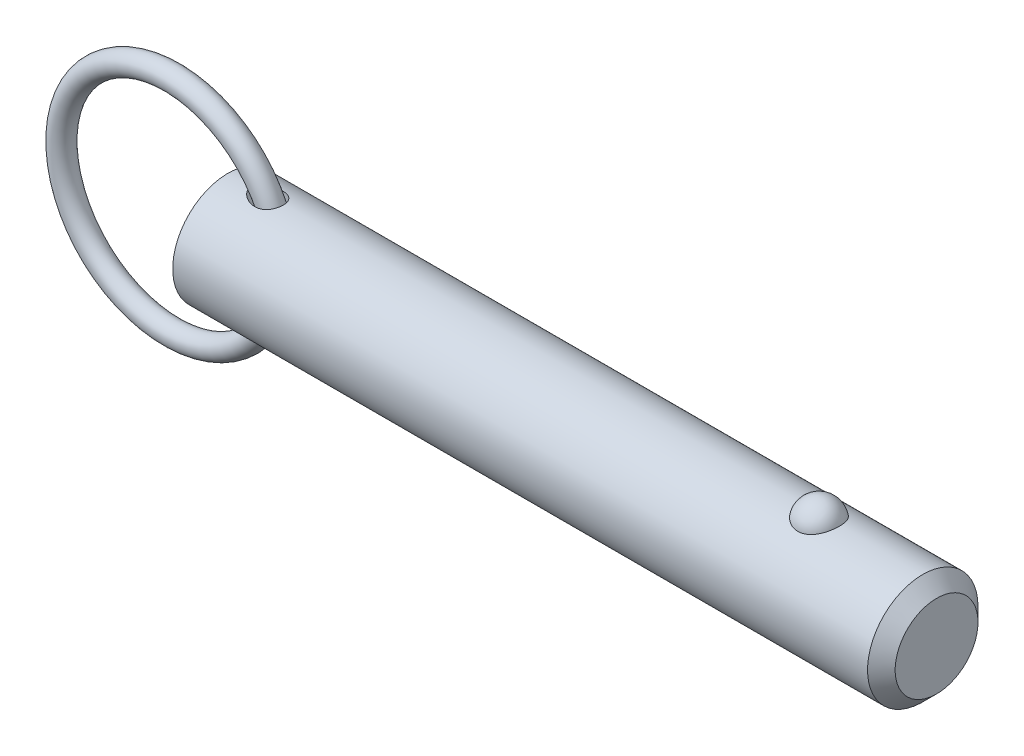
ISO-10303-21;
HEADER;
FILE_DESCRIPTION(('STEP AP214'),'2;1');
FILE_NAME('part.step','',(''),(''),'','','');
FILE_SCHEMA(('AUTOMOTIVE_DESIGN { 1 0 10303 214 1 1 1 1 }'));
ENDSEC;
DATA;
#1=APPLICATION_CONTEXT('core data for automotive mechanical design processes');
#2=APPLICATION_PROTOCOL_DEFINITION('international standard','automotive_design',2000,#1);
#3=PRODUCT_CONTEXT('',#1,'mechanical');
#4=PRODUCT('Part','Part','',(#3));
#5=PRODUCT_RELATED_PRODUCT_CATEGORY('part','',(#4));
#6=PRODUCT_DEFINITION_FORMATION('','',#4);
#7=PRODUCT_DEFINITION_CONTEXT('part definition',#1,'design');
#8=PRODUCT_DEFINITION('design','',#6,#7);
#9=PRODUCT_DEFINITION_SHAPE('','',#8);
#10=(LENGTH_UNIT() NAMED_UNIT(*) SI_UNIT(.MILLI.,.METRE.));
#11=(NAMED_UNIT(*) PLANE_ANGLE_UNIT() SI_UNIT($,.RADIAN.));
#12=(NAMED_UNIT(*) SI_UNIT($,.STERADIAN.) SOLID_ANGLE_UNIT());
#13=UNCERTAINTY_MEASURE_WITH_UNIT(LENGTH_MEASURE(1.E-05),#10,'distance_accuracy_value','');
#14=(GEOMETRIC_REPRESENTATION_CONTEXT(3) GLOBAL_UNCERTAINTY_ASSIGNED_CONTEXT((#13)) GLOBAL_UNIT_ASSIGNED_CONTEXT((#10,
#11,#12)) REPRESENTATION_CONTEXT('',''));
#15=CARTESIAN_POINT('',(0.,0.,0.));
#16=DIRECTION('',(0.,0.,1.));
#17=DIRECTION('',(1.,0.,0.));
#18=AXIS2_PLACEMENT_3D('',#15,#16,#17);
#19=CARTESIAN_POINT('',(-9.66825126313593,0.,0.));
#20=DIRECTION('',(0.,0.,1.));
#21=DIRECTION('',(1.,0.,0.));
#22=AXIS2_PLACEMENT_3D('',#19,#20,#21);
#23=TOROIDAL_SURFACE('',#22,19.05,1.905);
#24=CARTESIAN_POINT('',(11.2867487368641,0.,0.));
#25=VERTEX_POINT('',#24);
#26=VERTEX_LOOP('',#25);
#27=FACE_BOUND('',#26,.T.);
#28=ADVANCED_FACE('P0_F12',(#27),#23,.T.);
#29=CLOSED_SHELL('',(#28));
#30=MANIFOLD_SOLID_BREP('P0_B1',#29);
#31=CARTESIAN_POINT('',(0.,0.,0.));
#32=DIRECTION('',(1.,0.,0.));
#33=DIRECTION('',(0.,0.,-1.));
#34=AXIS2_PLACEMENT_3D('',#31,#32,#33);
#35=CYLINDRICAL_SURFACE('',#34,9.525);
#36=CARTESIAN_POINT('',(4.56693409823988,9.43141941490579,-1.33189820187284));
#37=CARTESIAN_POINT('',(4.70260475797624,9.41020313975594,-1.48215931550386));
#38=CARTESIAN_POINT('',(4.85555680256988,9.38755003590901,-1.61683982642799));
#39=CARTESIAN_POINT('',(5.10171959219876,9.35450554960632,-1.79512943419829));
#40=CARTESIAN_POINT('',(5.18674514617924,9.34362629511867,-1.85068909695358));
#41=CARTESIAN_POINT('',(5.36154389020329,9.32258514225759,-1.95392002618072));
#42=CARTESIAN_POINT('',(5.45131542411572,9.31242299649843,-2.00159402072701));
#43=CARTESIAN_POINT('',(5.70070211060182,9.28632120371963,-2.12033289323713));
#44=CARTESIAN_POINT('',(5.86420408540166,9.27146938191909,-2.18362944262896));
#45=CARTESIAN_POINT('',(6.19893345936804,9.24694163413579,-2.28525783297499));
#46=CARTESIAN_POINT('',(6.37015384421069,9.23726110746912,-2.32361187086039));
#47=CARTESIAN_POINT('',(6.73531776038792,9.22400982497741,-2.37575048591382));
#48=CARTESIAN_POINT('',(6.92975826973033,9.22118808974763,-2.38652934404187));
#49=CARTESIAN_POINT('',(7.21995443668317,9.22416297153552,-2.37494980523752));
#50=CARTESIAN_POINT('',(7.31643847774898,9.22635560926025,-2.366466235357));
#51=CARTESIAN_POINT('',(7.50796421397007,9.2331428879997,-2.33985028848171));
#52=CARTESIAN_POINT('',(7.60300650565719,9.23773650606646,-2.32172202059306));
#53=CARTESIAN_POINT('',(7.83273114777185,9.25183311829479,-2.26504721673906));
#54=CARTESIAN_POINT('',(7.96603028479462,9.26261470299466,-2.2209856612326));
#55=CARTESIAN_POINT('',(8.22310899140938,9.28816519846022,-2.11157306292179));
#56=CARTESIAN_POINT('',(8.34689477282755,9.30293147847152,-2.04623606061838));
#57=CARTESIAN_POINT('',(8.58136049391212,9.3349416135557,-1.89485344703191));
#58=CARTESIAN_POINT('',(8.69199721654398,9.35219324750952,-1.80874222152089));
#59=CARTESIAN_POINT('',(8.89592093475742,9.38707016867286,-1.61799188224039));
#60=CARTESIAN_POINT('',(8.98920771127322,9.40469546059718,-1.51335253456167));
#61=CARTESIAN_POINT('',(9.15057731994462,9.43713590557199,-1.29519427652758));
#62=CARTESIAN_POINT('',(9.21980158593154,9.45205440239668,-1.18253282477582));
#63=CARTESIAN_POINT('',(9.33826736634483,9.47856708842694,-0.946802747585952));
#64=CARTESIAN_POINT('',(9.38751161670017,9.49016173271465,-0.823735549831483));
#65=CARTESIAN_POINT('',(9.46423850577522,9.50859378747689,-0.572614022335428));
#66=CARTESIAN_POINT('',(9.4920239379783,9.5154972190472,-0.444656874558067));
#67=CARTESIAN_POINT('',(9.52636926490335,9.52406905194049,-0.185752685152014));
#68=CARTESIAN_POINT('',(9.5329292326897,9.52573747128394,-0.0548056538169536));
#69=CARTESIAN_POINT('',(9.52467276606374,9.52365852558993,0.206503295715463));
#70=CARTESIAN_POINT('',(9.50983454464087,9.51990564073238,0.336864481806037));
#71=CARTESIAN_POINT('',(9.45907362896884,9.50737852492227,0.59316631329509));
#72=CARTESIAN_POINT('',(9.42315106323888,9.49860432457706,0.71910698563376));
#73=CARTESIAN_POINT('',(9.33106648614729,9.47698928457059,0.96295935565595));
#74=CARTESIAN_POINT('',(9.27490839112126,9.46414923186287,1.08087260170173));
#75=CARTESIAN_POINT('',(9.1437580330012,9.43581000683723,1.30534632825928));
#76=CARTESIAN_POINT('',(9.06876720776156,9.42031103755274,1.41190767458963));
#77=CARTESIAN_POINT('',(8.90203187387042,9.38836719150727,1.61069439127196));
#78=CARTESIAN_POINT('',(8.81029913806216,9.37192298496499,1.70292975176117));
#79=CARTESIAN_POINT('',(8.61268775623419,9.33985045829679,1.87086859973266));
#80=CARTESIAN_POINT('',(8.50680947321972,9.3242221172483,1.94657251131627));
#81=CARTESIAN_POINT('',(8.28220546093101,9.29513431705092,2.08109032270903));
#82=CARTESIAN_POINT('',(8.16329919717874,9.28171415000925,2.1396103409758));
#83=CARTESIAN_POINT('',(7.91756052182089,9.25859072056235,2.23755716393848));
#84=CARTESIAN_POINT('',(7.79072606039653,9.24888842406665,2.27697900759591));
#85=CARTESIAN_POINT('',(7.52377913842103,9.23338749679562,2.33907806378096));
#86=CARTESIAN_POINT('',(7.38334767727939,9.22789571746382,2.36044900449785));
#87=CARTESIAN_POINT('',(7.10081394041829,9.22210229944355,2.3829751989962));
#88=CARTESIAN_POINT('',(6.95871103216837,9.22180269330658,2.38412253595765));
#89=CARTESIAN_POINT('',(6.65642691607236,9.22632724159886,2.36656230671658));
#90=CARTESIAN_POINT('',(6.49641694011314,9.23185415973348,2.3451317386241));
#91=CARTESIAN_POINT('',(6.18115433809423,9.24811737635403,2.28014143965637));
#92=CARTESIAN_POINT('',(6.02590710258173,9.25885936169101,2.23655754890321));
#93=CARTESIAN_POINT('',(5.6990472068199,9.28624254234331,2.12025087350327));
#94=CARTESIAN_POINT('',(5.52873601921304,9.30354853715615,2.04400672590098));
#95=CARTESIAN_POINT('',(5.20289495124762,9.34106989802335,1.86504730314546));
#96=CARTESIAN_POINT('',(5.04735968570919,9.36128419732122,1.76234172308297));
#97=CARTESIAN_POINT('',(4.79287124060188,9.39697639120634,1.55895334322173));
#98=CARTESIAN_POINT('',(4.68938704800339,9.41240250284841,1.46392900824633));
#99=CARTESIAN_POINT('',(4.49847141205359,9.44202586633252,1.25875918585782));
#100=CARTESIAN_POINT('',(4.41101129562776,9.45622528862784,1.1486413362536));
#101=CARTESIAN_POINT('',(4.27502257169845,9.47888210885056,0.940600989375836));
#102=CARTESIAN_POINT('',(4.22216329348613,9.48791121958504,0.845586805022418));
#103=CARTESIAN_POINT('',(4.13241478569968,9.50344321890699,0.648051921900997));
#104=CARTESIAN_POINT('',(4.09551182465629,9.50994827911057,0.545537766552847));
#105=CARTESIAN_POINT('',(4.04043124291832,9.51971586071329,0.334452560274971));
#106=CARTESIAN_POINT('',(4.02240728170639,9.52295176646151,0.225839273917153));
#107=CARTESIAN_POINT('',(4.00750873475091,9.52562364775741,0.00713006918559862));
#108=CARTESIAN_POINT('',(4.01062334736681,9.52506156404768,-0.10296506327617));
#109=CARTESIAN_POINT('',(4.03592967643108,9.52053221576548,-0.306944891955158));
#110=CARTESIAN_POINT('',(4.05571676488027,9.51699426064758,-0.401151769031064));
#111=CARTESIAN_POINT('',(4.10967975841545,9.5074546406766,-0.585176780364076));
#112=CARTESIAN_POINT('',(4.14385995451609,9.50145224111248,-0.674993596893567));
#113=CARTESIAN_POINT('',(4.23261356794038,9.48611703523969,-0.866116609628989));
#114=CARTESIAN_POINT('',(4.28990016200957,9.47635800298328,-0.96612166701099));
#115=CARTESIAN_POINT('',(4.41856577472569,9.45502867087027,-1.15640011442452));
#116=CARTESIAN_POINT('',(4.48996918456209,9.44345524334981,-1.24665623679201));
#117=CARTESIAN_POINT('',(4.56693409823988,9.43141941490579,-1.33189820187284));
#118=B_SPLINE_CURVE_WITH_KNOTS('',3,(#36,#37,#38,#39,#40,#41,#42,#43,#44,#45,#46,#47,#48,#49,
#50,#51,#52,#53,#54,#55,#56,#57,#58,#59,#60,#61,#62,#63,#64,#65,#66,#67,#68,#69,#70,#71,#72,#73,
#74,#75,#76,#77,#78,#79,#80,#81,#82,#83,#84,#85,#86,#87,#88,#89,#90,#91,#92,#93,#94,#95,#96,#97,
#98,#99,#100,#101,#102,#103,#104,#105,#106,#107,#108,#109,#110,#111,#112,#113,#114,#115,#116,
#117),.UNSPECIFIED.,.T.,.F.,(4,2,2,2,2,2,2,2,2,2,2,2,2,2,2,2,2,2,2,2,2,2,2,2,2,2,2,2,2,2,2,2,2,
2,2,2,2,2,2,2,4),(0.,0.609951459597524,0.916123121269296,1.22218863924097,1.74791337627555,
2.27316961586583,2.85362722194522,3.14383229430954,3.43391382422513,3.85437497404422,
4.27455920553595,4.69608835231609,5.11762282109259,5.5149005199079,5.91212379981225,
6.30363414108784,6.69514313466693,7.08705103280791,7.47895654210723,7.87078624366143,
8.26258603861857,8.65411137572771,9.04562666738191,9.44349251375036,9.84146165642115,
10.2662286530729,10.6911619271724,11.1739180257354,11.6572017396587,12.2170157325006,
12.7766249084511,13.1992556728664,13.6211226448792,13.9471990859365,14.2729943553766,
14.6014211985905,14.9296802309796,15.2173810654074,15.505167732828,15.8505863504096,
16.1966070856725),.UNSPECIFIED.);
#119=CARTESIAN_POINT('',(4.56693409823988,9.43141941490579,-1.33189820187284));
#120=VERTEX_POINT('',#119);
#121=EDGE_CURVE('P1_E40',#120,#120,#118,.T.);
#122=ORIENTED_EDGE('',*,*,#121,.T.);
#123=EDGE_LOOP('',(#122));
#124=FACE_BOUND('',#123,.T.);
#125=CARTESIAN_POINT('',(119.84875,0.,0.));
#126=DIRECTION('',(1.,0.,0.));
#127=DIRECTION('',(0.,0.,-1.));
#128=AXIS2_PLACEMENT_3D('',#125,#126,#127);
#129=CIRCLE('',#128,9.525);
#130=CARTESIAN_POINT('',(119.84875,0.,-9.525));
#131=VERTEX_POINT('',#130);
#132=EDGE_CURVE('P1_E25',#131,#131,#129,.T.);
#133=ORIENTED_EDGE('',*,*,#132,.F.);
#134=EDGE_LOOP('',(#133));
#135=FACE_BOUND('',#134,.T.);
#136=CARTESIAN_POINT('',(0.,0.,0.));
#137=DIRECTION('',(1.,0.,0.));
#138=DIRECTION('',(0.,0.,-1.));
#139=AXIS2_PLACEMENT_3D('',#136,#137,#138);
#140=CIRCLE('',#139,9.525);
#141=CARTESIAN_POINT('',(0.,0.,-9.525));
#142=VERTEX_POINT('',#141);
#143=EDGE_CURVE('P1_E9',#142,#142,#140,.T.);
#144=ORIENTED_EDGE('',*,*,#143,.T.);
#145=EDGE_LOOP('',(#144));
#146=FACE_BOUND('',#145,.T.);
#147=CARTESIAN_POINT('',(101.945757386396,8.80405803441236,3.63513233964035));
#148=CARTESIAN_POINT('',(101.851676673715,8.80405953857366,3.63513053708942));
#149=CARTESIAN_POINT('',(101.757561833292,8.80561325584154,3.6313746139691));
#150=CARTESIAN_POINT('',(101.570012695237,8.81177748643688,3.61638665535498));
#151=CARTESIAN_POINT('',(101.476578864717,8.81638992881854,3.60514990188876));
#152=CARTESIAN_POINT('',(101.197945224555,8.8346711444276,3.56024627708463));
#153=CARTESIAN_POINT('',(101.014691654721,8.85278327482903,3.51538626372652));
#154=CARTESIAN_POINT('',(100.659509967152,8.89871214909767,3.39742145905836));
#155=CARTESIAN_POINT('',(100.487553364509,8.9265032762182,3.32439116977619));
#156=CARTESIAN_POINT('',(100.158707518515,8.98874819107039,3.15220244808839));
#157=CARTESIAN_POINT('',(100.001811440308,9.02319893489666,3.05305594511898));
#158=CARTESIAN_POINT('',(99.7022147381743,9.09629186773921,2.82797815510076));
#159=CARTESIAN_POINT('',(99.5600600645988,9.13502685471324,2.7013513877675));
#160=CARTESIAN_POINT('',(99.2982999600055,9.2118657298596,2.4264193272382));
#161=CARTESIAN_POINT('',(99.1787015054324,9.2499694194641,2.27810735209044));
#162=CARTESIAN_POINT('',(98.959645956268,9.3234108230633,1.95652290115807));
#163=CARTESIAN_POINT('',(98.8613174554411,9.35855090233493,1.78243511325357));
#164=CARTESIAN_POINT('',(98.6938190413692,9.42045142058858,1.41937246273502));
#165=CARTESIAN_POINT('',(98.6246511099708,9.44721128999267,1.23039658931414));
#166=CARTESIAN_POINT('',(98.5161994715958,9.48990641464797,0.840370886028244));
#167=CARTESIAN_POINT('',(98.4772880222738,9.50570658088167,0.639202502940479));
#168=CARTESIAN_POINT('',(98.4315550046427,9.52433146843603,0.232664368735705));
#169=CARTESIAN_POINT('',(98.4247324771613,9.52715657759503,0.0272947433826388));
#170=CARTESIAN_POINT('',(98.443255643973,9.51956918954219,-0.380478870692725));
#171=CARTESIAN_POINT('',(98.4684052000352,9.50923740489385,-0.58289331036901));
#172=CARTESIAN_POINT('',(98.5500253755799,9.47651897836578,-0.980293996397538));
#173=CARTESIAN_POINT('',(98.6064966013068,9.45413210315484,-1.17528009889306));
#174=CARTESIAN_POINT('',(98.7497192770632,9.39954044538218,-1.55263697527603));
#175=CARTESIAN_POINT('',(98.8365124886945,9.36732213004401,-1.73498993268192));
#176=CARTESIAN_POINT('',(99.0386103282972,9.29640700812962,-2.08177763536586));
#177=CARTESIAN_POINT('',(99.1539172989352,9.25770966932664,-2.24621090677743));
#178=CARTESIAN_POINT('',(99.411264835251,9.17775604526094,-2.5533833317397));
#179=CARTESIAN_POINT('',(99.5534344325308,9.136488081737,-2.696011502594));
#180=CARTESIAN_POINT('',(99.86089985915,9.05620497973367,-2.95451229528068));
#181=CARTESIAN_POINT('',(100.026193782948,9.01718965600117,-3.07038711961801));
#182=CARTESIAN_POINT('',(100.372052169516,8.9468001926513,-3.26976836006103));
#183=CARTESIAN_POINT('',(100.552227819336,8.91528408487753,-3.35389750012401));
#184=CARTESIAN_POINT('',(100.925651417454,8.86272514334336,-3.49043503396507));
#185=CARTESIAN_POINT('',(101.118894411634,8.8416783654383,-3.54285537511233));
#186=CARTESIAN_POINT('',(101.502503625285,8.81348056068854,-3.61241306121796));
#187=CARTESIAN_POINT('',(101.692525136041,8.80568348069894,-3.63119339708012));
#188=CARTESIAN_POINT('',(102.073190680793,8.80289410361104,-3.63795342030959));
#189=CARTESIAN_POINT('',(102.263834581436,8.80789922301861,-3.62593932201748));
#190=CARTESIAN_POINT('',(102.634007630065,8.8297491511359,-3.57238430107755));
#191=CARTESIAN_POINT('',(102.813697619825,8.84621463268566,-3.53178890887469));
#192=CARTESIAN_POINT('',(103.163422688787,8.88875330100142,-3.42331083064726));
#193=CARTESIAN_POINT('',(103.333456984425,8.91482726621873,-3.35542593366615));
#194=CARTESIAN_POINT('',(103.663237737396,8.97448239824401,-3.19248225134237));
#195=CARTESIAN_POINT('',(103.822680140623,9.00821446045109,-3.09686474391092));
#196=CARTESIAN_POINT('',(104.123513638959,9.07935398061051,-2.88162736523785));
#197=CARTESIAN_POINT('',(104.264900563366,9.11676228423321,-2.76200196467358));
#198=CARTESIAN_POINT('',(104.53331931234,9.19347419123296,-2.49516285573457));
#199=CARTESIAN_POINT('',(104.659275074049,9.23277872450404,-2.34686614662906));
#200=CARTESIAN_POINT('',(104.885522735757,9.30737610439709,-2.03093683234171));
#201=CARTESIAN_POINT('',(104.98581004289,9.34266823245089,-1.86330077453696));
#202=CARTESIAN_POINT('',(105.161514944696,9.40674710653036,-1.50744893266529));
#203=CARTESIAN_POINT('',(105.236041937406,9.4352917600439,-1.31874876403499));
#204=CARTESIAN_POINT('',(105.35416505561,9.48144132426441,-0.930631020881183));
#205=CARTESIAN_POINT('',(105.397760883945,9.49904612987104,-0.731213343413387));
#206=CARTESIAN_POINT('',(105.453158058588,9.5215314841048,-0.327147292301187));
#207=CARTESIAN_POINT('',(105.464935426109,9.52640243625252,-0.122495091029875));
#208=CARTESIAN_POINT('',(105.456382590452,9.52289571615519,0.286018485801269));
#209=CARTESIAN_POINT('',(105.43605305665,9.51451832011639,0.489879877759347));
#210=CARTESIAN_POINT('',(105.363884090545,9.48544083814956,0.88999431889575));
#211=CARTESIAN_POINT('',(105.312199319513,9.46480124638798,1.08627971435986));
#212=CARTESIAN_POINT('',(105.178491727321,9.4133389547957,1.46682086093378));
#213=CARTESIAN_POINT('',(105.096466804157,9.38251554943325,1.65107577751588));
#214=CARTESIAN_POINT('',(104.90319292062,9.31365636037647,2.00346348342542));
#215=CARTESIAN_POINT('',(104.791783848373,9.27558138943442,2.17150083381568));
#216=CARTESIAN_POINT('',(104.542294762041,9.19638714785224,2.48563115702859));
#217=CARTESIAN_POINT('',(104.404216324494,9.15526805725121,2.63172542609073));
#218=CARTESIAN_POINT('',(104.104843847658,9.07465393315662,2.89750997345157));
#219=CARTESIAN_POINT('',(103.943610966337,9.03515496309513,3.01726776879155));
#220=CARTESIAN_POINT('',(103.601613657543,8.96227564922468,3.22732920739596));
#221=CARTESIAN_POINT('',(103.420841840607,8.92889763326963,3.31762165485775));
#222=CARTESIAN_POINT('',(103.051445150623,8.8734538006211,3.46314419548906));
#223=CARTESIAN_POINT('',(102.86332371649,8.85102983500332,3.51950082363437));
#224=CARTESIAN_POINT('',(102.57578699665,8.82666967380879,3.57993683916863));
#225=CARTESIAN_POINT('',(102.479133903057,8.82009725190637,3.59606217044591));
#226=CARTESIAN_POINT('',(102.284677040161,8.81020897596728,3.62022512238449));
#227=CARTESIAN_POINT('',(102.18687410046,8.80689090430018,3.62826825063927));
#228=CARTESIAN_POINT('',(102.041224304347,8.80445615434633,3.63416760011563));
#229=CARTESIAN_POINT('',(101.993495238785,8.80405727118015,3.63513325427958));
#230=CARTESIAN_POINT('',(101.945757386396,8.80405803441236,3.63513233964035));
#231=B_SPLINE_CURVE_WITH_KNOTS('',3,(#147,#148,#149,#150,#151,#152,#153,#154,#155,#156,#157,
#158,#159,#160,#161,#162,#163,#164,#165,#166,#167,#168,#169,#170,#171,#172,#173,#174,#175,#176,
#177,#178,#179,#180,#181,#182,#183,#184,#185,#186,#187,#188,#189,#190,#191,#192,#193,#194,#195,
#196,#197,#198,#199,#200,#201,#202,#203,#204,#205,#206,#207,#208,#209,#210,#211,#212,#213,#214,
#215,#216,#217,#218,#219,#220,#221,#222,#223,#224,#225,#226,#227,#228,#229,#230),.UNSPECIFIED.,
.T.,.F.,(4,2,2,2,2,2,2,2,2,2,2,2,2,2,2,2,2,2,2,2,2,2,2,2,2,2,2,2,2,2,2,2,2,2,2,2,2,2,2,2,2,4),
(0.,0.282202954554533,0.564584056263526,1.13017050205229,1.69427128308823,2.258114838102,
2.83836627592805,3.41879688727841,4.02497117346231,4.63118665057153,5.24474754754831,
5.85829010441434,6.46808687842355,7.07789545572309,7.68854723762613,8.29924920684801,
8.91296283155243,9.52662591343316,10.1275338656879,10.7282152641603,11.2986646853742,
11.868998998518,12.4213015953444,12.973648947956,13.5380053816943,14.1024919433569,
14.695298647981,15.2882113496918,15.8999469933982,16.5116885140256,17.1238909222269,
17.7360805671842,18.3452748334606,18.9545113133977,19.567138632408,20.1797297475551,
20.7907316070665,21.4019653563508,21.9915938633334,22.2859053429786,22.5800161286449,
22.723209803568),.UNSPECIFIED.);
#232=CARTESIAN_POINT('',(101.945757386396,8.80405803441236,3.63513233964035));
#233=VERTEX_POINT('',#232);
#234=EDGE_CURVE('P1_E34',#233,#233,#231,.T.);
#235=ORIENTED_EDGE('',*,*,#234,.T.);
#236=EDGE_LOOP('',(#235));
#237=FACE_BOUND('',#236,.T.);
#238=CARTESIAN_POINT('',(4.56693409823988,-9.43141941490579,-1.33189820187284));
#239=CARTESIAN_POINT('',(4.48932984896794,-9.4435553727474,-1.24594548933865));
#240=CARTESIAN_POINT('',(4.41737309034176,-9.45522193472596,-1.1548795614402));
#241=CARTESIAN_POINT('',(4.2878104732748,-9.47670896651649,-0.962782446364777));
#242=CARTESIAN_POINT('',(4.23019403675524,-9.48653079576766,-0.861758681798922));
#243=CARTESIAN_POINT('',(4.13254559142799,-9.5034118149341,-0.649723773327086));
#244=CARTESIAN_POINT('',(4.09271158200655,-9.51043980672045,-0.538615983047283));
#245=CARTESIAN_POINT('',(4.04973167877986,-9.51806966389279,-0.367764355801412));
#246=CARTESIAN_POINT('',(4.03820037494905,-9.52012756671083,-0.310118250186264));
#247=CARTESIAN_POINT('',(4.02100287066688,-9.52320274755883,-0.193935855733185));
#248=CARTESIAN_POINT('',(4.01533565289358,-9.52422020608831,-0.13539972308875));
#249=CARTESIAN_POINT('',(4.00817074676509,-9.52550497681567,0.0247266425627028));
#250=CARTESIAN_POINT('',(4.01270492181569,-9.52468821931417,0.126661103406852));
#251=CARTESIAN_POINT('',(4.03954973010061,-9.51988506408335,0.328012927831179));
#252=CARTESIAN_POINT('',(4.06186450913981,-9.51589792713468,0.427429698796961));
#253=CARTESIAN_POINT('',(4.12088980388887,-9.5054852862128,0.61636200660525));
#254=CARTESIAN_POINT('',(4.15684838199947,-9.49918763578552,0.706123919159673));
#255=CARTESIAN_POINT('',(4.24094647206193,-9.48470618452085,0.879522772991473));
#256=CARTESIAN_POINT('',(4.28909090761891,-9.47652162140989,0.96315722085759));
#257=CARTESIAN_POINT('',(4.42295891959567,-9.45426317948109,1.16513741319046));
#258=CARTESIAN_POINT('',(4.5152375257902,-9.43933320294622,1.27905352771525));
#259=CARTESIAN_POINT('',(4.71682295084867,-9.40825940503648,1.49055892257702));
#260=CARTESIAN_POINT('',(4.8261728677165,-9.39211256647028,1.58810554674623));
#261=CARTESIAN_POINT('',(5.09064226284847,-9.35555264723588,1.79246125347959));
#262=CARTESIAN_POINT('',(5.24990411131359,-9.33524115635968,1.89393122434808));
#263=CARTESIAN_POINT('',(5.58309255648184,-9.29785396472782,2.06968659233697));
#264=CARTESIAN_POINT('',(5.7570289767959,-9.28078045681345,2.14395359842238));
#265=CARTESIAN_POINT('',(6.11646882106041,-9.25213303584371,2.26440412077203));
#266=CARTESIAN_POINT('',(6.30205582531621,-9.2406056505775,2.31035092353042));
#267=CARTESIAN_POINT('',(6.67856093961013,-9.22541807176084,2.37029728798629));
#268=CARTESIAN_POINT('',(6.8694704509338,-9.2217458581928,2.3843456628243));
#269=CARTESIAN_POINT('',(7.21217144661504,-9.22344239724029,2.37775005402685));
#270=CARTESIAN_POINT('',(7.36409439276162,-9.22713860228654,2.36352577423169));
#271=CARTESIAN_POINT('',(7.66346227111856,-9.24048072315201,2.31082299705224));
#272=CARTESIAN_POINT('',(7.81090958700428,-9.25012341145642,2.27235765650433));
#273=CARTESIAN_POINT('',(8.09730316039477,-9.2746609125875,2.17003648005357));
#274=CARTESIAN_POINT('',(8.23619652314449,-9.28958517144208,2.10603803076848));
#275=CARTESIAN_POINT('',(8.49918675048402,-9.32290326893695,1.9532444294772));
#276=CARTESIAN_POINT('',(8.62328895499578,-9.34129584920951,1.86445826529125));
#277=CARTESIAN_POINT('',(8.84006515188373,-9.37706953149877,1.67466761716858));
#278=CARTESIAN_POINT('',(8.93465172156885,-9.39436331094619,1.57582357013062));
#279=CARTESIAN_POINT('',(9.1049023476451,-9.42761680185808,1.362809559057));
#280=CARTESIAN_POINT('',(9.18057146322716,-9.44357686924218,1.24864370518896));
#281=CARTESIAN_POINT('',(9.30789178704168,-9.47159985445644,1.01379272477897));
#282=CARTESIAN_POINT('',(9.36045544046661,-9.48380365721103,0.893617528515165));
#283=CARTESIAN_POINT('',(9.44498362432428,-9.50388751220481,0.645890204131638));
#284=CARTESIAN_POINT('',(9.47694947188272,-9.51176784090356,0.518338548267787));
#285=CARTESIAN_POINT('',(9.51944262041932,-9.52232073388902,0.260103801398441));
#286=CARTESIAN_POINT('',(9.53006646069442,-9.52501674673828,0.129437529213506));
#287=CARTESIAN_POINT('',(9.52993291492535,-9.52498309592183,-0.131885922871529));
#288=CARTESIAN_POINT('',(9.51917525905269,-9.52225336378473,-0.262543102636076));
#289=CARTESIAN_POINT('',(9.47648788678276,-9.51165418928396,-0.520312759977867));
#290=CARTESIAN_POINT('',(9.44453086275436,-9.50377811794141,-0.647420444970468));
#291=CARTESIAN_POINT('',(9.36015568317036,-9.48373425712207,-0.894290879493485));
#292=CARTESIAN_POINT('',(9.30773827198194,-9.47156662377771,-1.01405389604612));
#293=CARTESIAN_POINT('',(9.18380895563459,-9.44428888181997,-1.24269386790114));
#294=CARTESIAN_POINT('',(9.11232064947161,-9.42918241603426,-1.3515840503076));
#295=CARTESIAN_POINT('',(8.95212687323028,-9.39767706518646,-1.55562459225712));
#296=CARTESIAN_POINT('',(8.86342281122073,-9.3812782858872,-1.65077607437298));
#297=CARTESIAN_POINT('',(8.6710444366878,-9.34891827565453,-1.82517515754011));
#298=CARTESIAN_POINT('',(8.56732858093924,-9.33295841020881,-1.90437711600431));
#299=CARTESIAN_POINT('',(8.34818438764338,-9.30317889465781,-2.0449122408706));
#300=CARTESIAN_POINT('',(8.23275529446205,-9.2893593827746,-2.10624425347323));
#301=CARTESIAN_POINT('',(7.98961240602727,-9.26475003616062,-2.2120340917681));
#302=CARTESIAN_POINT('',(7.86162088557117,-9.25407358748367,-2.25587700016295));
#303=CARTESIAN_POINT('',(7.60027499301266,-9.23720810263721,-2.32397032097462));
#304=CARTESIAN_POINT('',(7.46691858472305,-9.23102078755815,-2.34821321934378));
#305=CARTESIAN_POINT('',(7.18516230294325,-9.22302718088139,-2.37943079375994));
#306=CARTESIAN_POINT('',(7.0365445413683,-9.22169704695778,-2.38452997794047));
#307=CARTESIAN_POINT('',(6.74015049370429,-9.22442327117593,-2.37395141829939));
#308=CARTESIAN_POINT('',(6.59237455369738,-9.22848170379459,-2.35826567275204));
#309=CARTESIAN_POINT('',(6.27762777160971,-9.2422287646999,-2.30385559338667));
#310=CARTESIAN_POINT('',(6.11124715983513,-9.25269504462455,-2.26192683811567));
#311=CARTESIAN_POINT('',(5.78635920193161,-9.27830776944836,-2.15445569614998));
#312=CARTESIAN_POINT('',(5.62786567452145,-9.29346211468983,-2.08887341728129));
#313=CARTESIAN_POINT('',(5.3901306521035,-9.31931237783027,-1.96924953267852));
#314=CARTESIAN_POINT('',(5.30683088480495,-9.32901725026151,-1.92292485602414));
#315=CARTESIAN_POINT('',(5.14455801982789,-9.34899035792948,-1.82334419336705));
#316=CARTESIAN_POINT('',(5.06558607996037,-9.35925874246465,-1.77008636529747));
#317=CARTESIAN_POINT('',(4.83670950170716,-9.39034445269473,-1.60010986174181));
#318=CARTESIAN_POINT('',(4.69422471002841,-9.41151337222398,-1.47288240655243));
#319=CARTESIAN_POINT('',(4.56693409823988,-9.43141941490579,-1.33189820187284));
#320=B_SPLINE_CURVE_WITH_KNOTS('',3,(#238,#239,#240,#241,#242,#243,#244,#245,#246,#247,#248,
#249,#250,#251,#252,#253,#254,#255,#256,#257,#258,#259,#260,#261,#262,#263,#264,#265,#266,#267,
#268,#269,#270,#271,#272,#273,#274,#275,#276,#277,#278,#279,#280,#281,#282,#283,#284,#285,#286,
#287,#288,#289,#290,#291,#292,#293,#294,#295,#296,#297,#298,#299,#300,#301,#302,#303,#304,#305,
#306,#307,#308,#309,#310,#311,#312,#313,#314,#315,#316,#317,#318,#319),.UNSPECIFIED.,.T.,.F.,(4,
2,2,2,2,2,2,2,2,2,2,2,2,2,2,2,2,2,2,2,2,2,2,2,2,2,2,2,2,2,2,2,2,2,2,2,2,2,2,2,4),(0.,
0.348900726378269,0.697543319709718,1.0499765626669,1.22617690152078,1.40234666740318,
1.70666745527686,2.01105922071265,2.30066493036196,2.59038784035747,3.03001384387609,
3.4707682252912,4.03766594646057,4.60494622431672,5.17690598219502,5.74798989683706,
6.2040084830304,6.65977977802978,7.11813321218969,7.57632066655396,7.98791759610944,
8.39940433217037,8.79273459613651,9.18603970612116,9.577561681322,9.96908859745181,
10.3611208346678,10.7531388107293,11.1446739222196,11.536177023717,11.9287850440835,
12.3214184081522,12.7268448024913,13.1324265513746,13.5768390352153,14.0214226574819,
14.5351685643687,15.0497849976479,15.3368801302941,15.6240516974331,16.1963372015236),.UNSPECIFIED.);
#321=CARTESIAN_POINT('',(4.56693409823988,-9.43141941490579,-1.33189820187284));
#322=VERTEX_POINT('',#321);
#323=EDGE_CURVE('P1_E17',#322,#322,#320,.T.);
#324=ORIENTED_EDGE('',*,*,#323,.T.);
#325=EDGE_LOOP('',(#324));
#326=FACE_BOUND('',#325,.T.);
#327=ADVANCED_FACE('P1_F13',(#124,#135,#146,#237,#326),#35,.T.);
#328=CARTESIAN_POINT('',(0.,0.,0.));
#329=DIRECTION('',(-1.,0.,0.));
#330=DIRECTION('',(0.,0.,1.));
#331=AXIS2_PLACEMENT_3D('',#328,#329,#330);
#332=PLANE('',#331);
#333=ORIENTED_EDGE('',*,*,#143,.F.);
#334=EDGE_LOOP('',(#333));
#335=FACE_BOUND('',#334,.T.);
#336=ADVANCED_FACE('P1_F15',(#335),#332,.T.);
#337=CARTESIAN_POINT('',(122.23,0.,0.));
#338=DIRECTION('',(-1.,0.,0.));
#339=DIRECTION('',(0.,0.,1.));
#340=AXIS2_PLACEMENT_3D('',#337,#338,#339);
#341=CONICAL_SURFACE('',#340,7.14375000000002,0.785398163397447);
#342=ORIENTED_EDGE('',*,*,#132,.T.);
#343=EDGE_LOOP('',(#342));
#344=FACE_BOUND('',#343,.T.);
#345=CARTESIAN_POINT('',(122.23,0.,0.));
#346=DIRECTION('',(1.,0.,0.));
#347=DIRECTION('',(0.,0.,-1.));
#348=AXIS2_PLACEMENT_3D('',#345,#346,#347);
#349=CIRCLE('',#348,7.14375000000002);
#350=CARTESIAN_POINT('',(122.23,0.,-7.14375000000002));
#351=VERTEX_POINT('',#350);
#352=EDGE_CURVE('P1_E30',#351,#351,#349,.T.);
#353=ORIENTED_EDGE('',*,*,#352,.F.);
#354=EDGE_LOOP('',(#353));
#355=FACE_BOUND('',#354,.T.);
#356=ADVANCED_FACE('P1_F55',(#344,#355),#341,.T.);
#357=CARTESIAN_POINT('',(122.23,7.14375000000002,0.));
#358=DIRECTION('',(1.,0.,0.));
#359=DIRECTION('',(0.,0.,-1.));
#360=AXIS2_PLACEMENT_3D('',#357,#358,#359);
#361=PLANE('',#360);
#362=ORIENTED_EDGE('',*,*,#352,.T.);
#363=EDGE_LOOP('',(#362));
#364=FACE_BOUND('',#363,.T.);
#365=ADVANCED_FACE('P1_F51',(#364),#361,.T.);
#366=CARTESIAN_POINT('',(101.945757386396,8.57249999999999,0.));
#367=DIRECTION('',(-1.,0.,0.));
#368=DIRECTION('',(0.,1.,0.));
#369=AXIS2_PLACEMENT_3D('',#366,#367,#368);
#370=SPHERICAL_SURFACE('',#369,3.64250000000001);
#371=ORIENTED_EDGE('',*,*,#234,.F.);
#372=EDGE_LOOP('',(#371));
#373=FACE_BOUND('',#372,.T.);
#374=ADVANCED_FACE('P1_F46',(#373),#370,.T.);
#375=CARTESIAN_POINT('',(-9.66825126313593,0.,0.));
#376=DIRECTION('',(0.,0.,1.));
#377=DIRECTION('',(1.,0.,0.));
#378=AXIS2_PLACEMENT_3D('',#375,#376,#377);
#379=TOROIDAL_SURFACE('',#378,19.05,2.38125);
#380=ORIENTED_EDGE('',*,*,#323,.F.);
#381=EDGE_LOOP('',(#380));
#382=FACE_BOUND('',#381,.T.);
#383=ORIENTED_EDGE('',*,*,#121,.F.);
#384=EDGE_LOOP('',(#383));
#385=FACE_BOUND('',#384,.T.);
#386=ADVANCED_FACE('P1_F50',(#382,#385),#379,.F.);
#387=CLOSED_SHELL('',(#327,#336,#356,#365,#374,#386));
#388=MANIFOLD_SOLID_BREP('P1_B1',#387);
#389=ADVANCED_BREP_SHAPE_REPRESENTATION('',(#18,#30,#388),#14);
#390=SHAPE_DEFINITION_REPRESENTATION(#9,#389);
ENDSEC;
END-ISO-10303-21;
